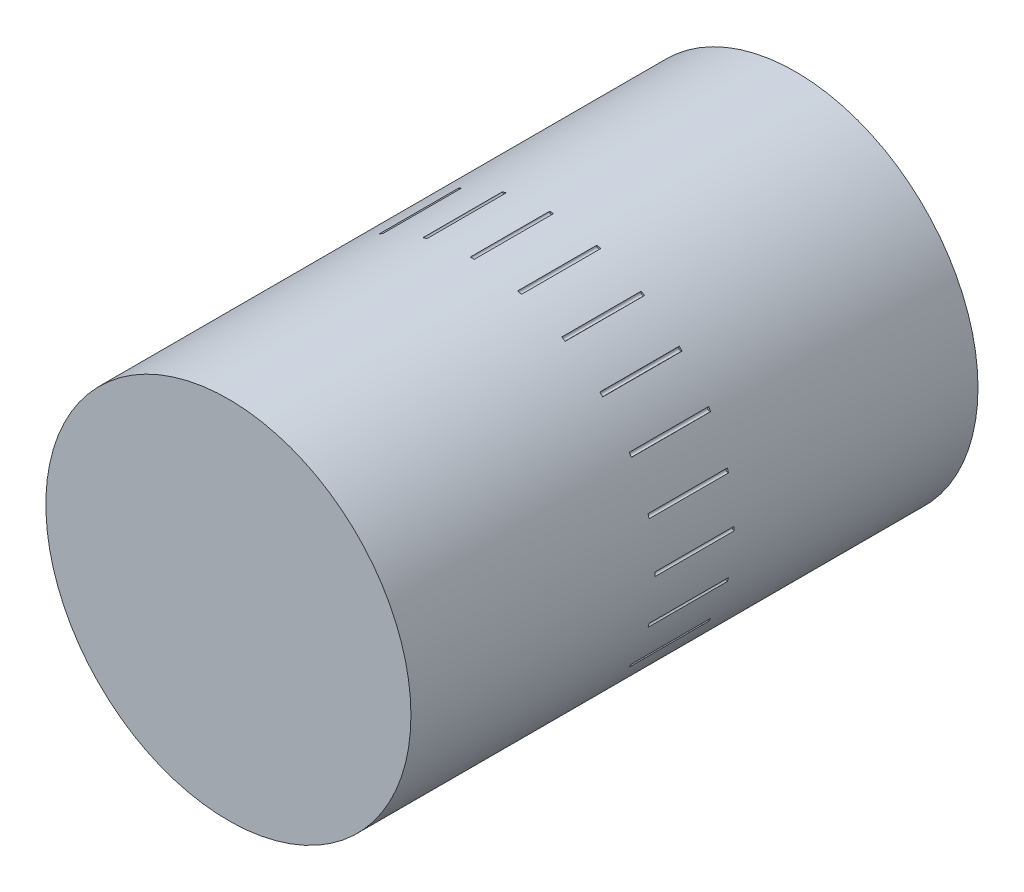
from build123d import *

# Parameters (mm, degrees)
SKIZZE1_R                       = 23.016475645
LINEAR_AUSTRAGEN1_DEPTH         = 35.75
SCHNITT_LINEAR_AUSTRAGEN1_DEPTH = 5
KREISMUSTER1_COUNT              = 24


with BuildPart() as part:
    # Skizze1 → Linear austragen1 (new, symmetric)
    with BuildSketch(Plane.XY):
        Circle(SKIZZE1_R)
    extrude(amount=LINEAR_AUSTRAGEN1_DEPTH, both=True)

    # Skizze2 → Schnitt-Linear austragen1 (cut, symmetric)
    with BuildSketch(Plane.XY):
        with BuildLine():
            ThreePointArc((-0.249996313, 23.015117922), (0, 22.766475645), (0.249996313, 23.015117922))
            ThreePointArc((0.249996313, 23.015117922), (0, 23.016475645), (-0.249996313, 23.015117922))
        make_face()
    schnitt_linear_austragen1 = extrude(amount=SCHNITT_LINEAR_AUSTRAGEN1_DEPTH, both=True, mode=Mode.SUBTRACT)

    # Kreismuster1: Schnitt-Linear austragen1 ×24 about axis
    kreismuster1_axis = Axis((0, 0, 0), (0, 0, 1))
    for i in range(1, KREISMUSTER1_COUNT):
        add(schnitt_linear_austragen1.rotate(kreismuster1_axis, i * 360 / KREISMUSTER1_COUNT), mode=Mode.SUBTRACT)


solid = part.part
